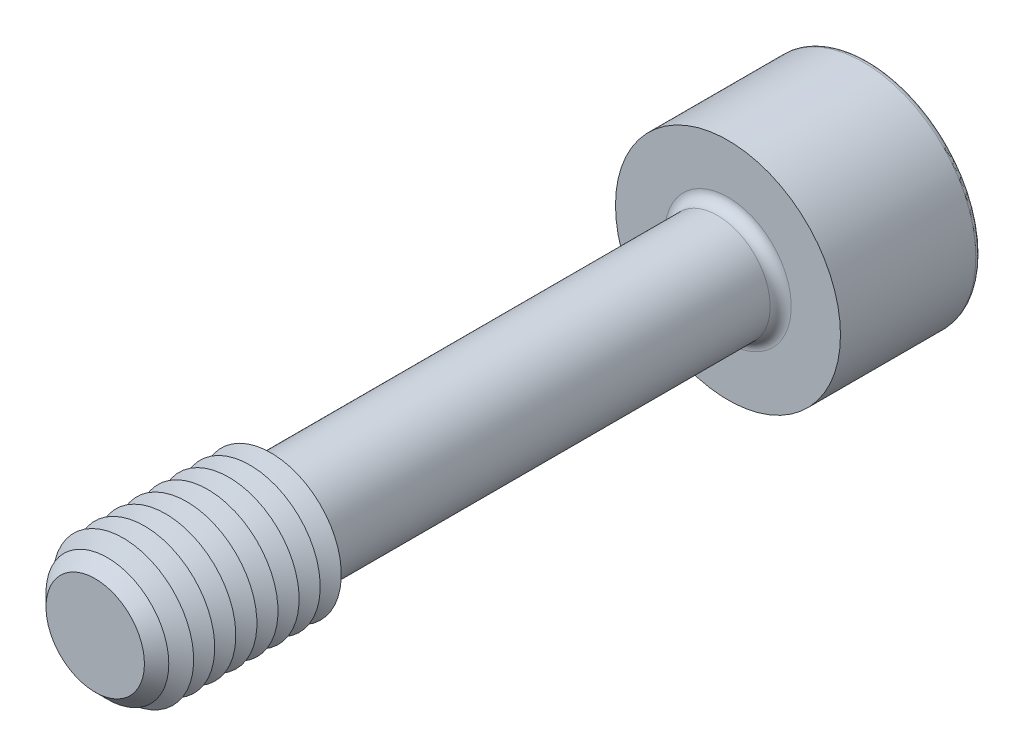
ISO-10303-21;
HEADER;
FILE_DESCRIPTION(('STEP AP214'),'2;1');
FILE_NAME('part.step','',(''),(''),'','','');
FILE_SCHEMA(('AUTOMOTIVE_DESIGN { 1 0 10303 214 1 1 1 1 }'));
ENDSEC;
DATA;
#1=APPLICATION_CONTEXT('core data for automotive mechanical design processes');
#2=APPLICATION_PROTOCOL_DEFINITION('international standard','automotive_design',2000,#1);
#3=PRODUCT_CONTEXT('',#1,'mechanical');
#4=PRODUCT('Part','Part','',(#3));
#5=PRODUCT_RELATED_PRODUCT_CATEGORY('part','',(#4));
#6=PRODUCT_DEFINITION_FORMATION('','',#4);
#7=PRODUCT_DEFINITION_CONTEXT('part definition',#1,'design');
#8=PRODUCT_DEFINITION('design','',#6,#7);
#9=PRODUCT_DEFINITION_SHAPE('','',#8);
#10=(LENGTH_UNIT() NAMED_UNIT(*) SI_UNIT(.MILLI.,.METRE.));
#11=(NAMED_UNIT(*) PLANE_ANGLE_UNIT() SI_UNIT($,.RADIAN.));
#12=(NAMED_UNIT(*) SI_UNIT($,.STERADIAN.) SOLID_ANGLE_UNIT());
#13=UNCERTAINTY_MEASURE_WITH_UNIT(LENGTH_MEASURE(1.E-05),#10,'distance_accuracy_value','');
#14=(GEOMETRIC_REPRESENTATION_CONTEXT(3) GLOBAL_UNCERTAINTY_ASSIGNED_CONTEXT((#13)) GLOBAL_UNIT_ASSIGNED_CONTEXT((#10,
#11,#12)) REPRESENTATION_CONTEXT('',''));
#15=CARTESIAN_POINT('',(0.,0.,0.));
#16=DIRECTION('',(0.,0.,1.));
#17=DIRECTION('',(1.,0.,0.));
#18=AXIS2_PLACEMENT_3D('',#15,#16,#17);
#19=CARTESIAN_POINT('',(-2.3094010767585,-4.,-24.5));
#20=DIRECTION('',(0.,0.,1.));
#21=DIRECTION('',(1.,0.,0.));
#22=AXIS2_PLACEMENT_3D('',#19,#20,#21);
#23=PLANE('',#22);
#24=DIRECTION('',(1.,0.,0.));
#25=VECTOR('',#24,1.);
#26=CARTESIAN_POINT('',(-2.3094010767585,-4.,-24.5));
#27=LINE('',#26,#25);
#28=CARTESIAN_POINT('',(0.,-4.,-24.5));
#29=VERTEX_POINT('',#28);
#30=CARTESIAN_POINT('',(2.3094010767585,-4.,-24.5));
#31=VERTEX_POINT('',#30);
#32=EDGE_CURVE('E763',#29,#31,#27,.T.);
#33=ORIENTED_EDGE('',*,*,#32,.F.);
#34=CARTESIAN_POINT('',(0.,0.,-24.5));
#35=DIRECTION('',(0.,0.,1.));
#36=DIRECTION('',(0.,-1.,0.));
#37=AXIS2_PLACEMENT_3D('',#34,#35,#36);
#38=CIRCLE('',#37,4.);
#39=CARTESIAN_POINT('',(3.46410161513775,-2.,-24.5));
#40=VERTEX_POINT('',#39);
#41=EDGE_CURVE('E53',#29,#40,#38,.T.);
#42=ORIENTED_EDGE('',*,*,#41,.T.);
#43=DIRECTION('',(0.5,0.866025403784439,0.));
#44=VECTOR('',#43,1.);
#45=CARTESIAN_POINT('',(2.3094010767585,-4.,-24.5));
#46=LINE('',#45,#44);
#47=EDGE_CURVE('E748',#31,#40,#46,.T.);
#48=ORIENTED_EDGE('',*,*,#47,.F.);
#49=EDGE_LOOP('',(#33,#42,#48));
#50=FACE_BOUND('',#49,.T.);
#51=ADVANCED_FACE('F41',(#50),#23,.F.);
#52=CARTESIAN_POINT('',(4.618802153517,0.,-24.5));
#53=VERTEX_POINT('',#52);
#54=EDGE_CURVE('E759',#40,#53,#46,.T.);
#55=ORIENTED_EDGE('',*,*,#54,.F.);
#56=CARTESIAN_POINT('',(3.46410161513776,2.,-24.5));
#57=VERTEX_POINT('',#56);
#58=EDGE_CURVE('E11',#40,#57,#38,.T.);
#59=ORIENTED_EDGE('',*,*,#58,.T.);
#60=DIRECTION('',(-0.5,0.866025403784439,0.));
#61=VECTOR('',#60,1.);
#62=CARTESIAN_POINT('',(4.618802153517,0.,-24.5));
#63=LINE('',#62,#61);
#64=EDGE_CURVE('E747',#53,#57,#63,.T.);
#65=ORIENTED_EDGE('',*,*,#64,.F.);
#66=EDGE_LOOP('',(#55,#59,#65));
#67=FACE_BOUND('',#66,.T.);
#68=ADVANCED_FACE('F133',(#67),#23,.F.);
#69=CARTESIAN_POINT('',(2.3094010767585,4.,-24.5));
#70=VERTEX_POINT('',#69);
#71=EDGE_CURVE('E743',#57,#70,#63,.T.);
#72=ORIENTED_EDGE('',*,*,#71,.F.);
#73=CARTESIAN_POINT('',(0.,4.,-24.5));
#74=VERTEX_POINT('',#73);
#75=EDGE_CURVE('E51',#57,#74,#38,.T.);
#76=ORIENTED_EDGE('',*,*,#75,.T.);
#77=DIRECTION('',(-1.,0.,0.));
#78=VECTOR('',#77,1.);
#79=CARTESIAN_POINT('',(2.3094010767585,4.,-24.5));
#80=LINE('',#79,#78);
#81=EDGE_CURVE('E177',#70,#74,#80,.T.);
#82=ORIENTED_EDGE('',*,*,#81,.F.);
#83=EDGE_LOOP('',(#72,#76,#82));
#84=FACE_BOUND('',#83,.T.);
#85=ADVANCED_FACE('F139',(#84),#23,.F.);
#86=CARTESIAN_POINT('',(-2.3094010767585,4.,-24.5));
#87=VERTEX_POINT('',#86);
#88=EDGE_CURVE('E753',#74,#87,#80,.T.);
#89=ORIENTED_EDGE('',*,*,#88,.F.);
#90=CARTESIAN_POINT('',(-3.46410161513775,2.,-24.5));
#91=VERTEX_POINT('',#90);
#92=EDGE_CURVE('E265',#74,#91,#38,.T.);
#93=ORIENTED_EDGE('',*,*,#92,.T.);
#94=DIRECTION('',(-0.500000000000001,-0.866025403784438,0.));
#95=VECTOR('',#94,1.);
#96=CARTESIAN_POINT('',(-2.3094010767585,4.,-24.5));
#97=LINE('',#96,#95);
#98=EDGE_CURVE('E176',#87,#91,#97,.T.);
#99=ORIENTED_EDGE('',*,*,#98,.F.);
#100=EDGE_LOOP('',(#89,#93,#99));
#101=FACE_BOUND('',#100,.T.);
#102=ADVANCED_FACE('F157',(#101),#23,.F.);
#103=CARTESIAN_POINT('',(-4.61880215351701,0.,-24.5));
#104=VERTEX_POINT('',#103);
#105=EDGE_CURVE('E170',#91,#104,#97,.T.);
#106=ORIENTED_EDGE('',*,*,#105,.F.);
#107=CARTESIAN_POINT('',(-3.46410161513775,-2.,-24.5));
#108=VERTEX_POINT('',#107);
#109=EDGE_CURVE('E172',#91,#108,#38,.T.);
#110=ORIENTED_EDGE('',*,*,#109,.T.);
#111=DIRECTION('',(0.5,-0.866025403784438,0.));
#112=VECTOR('',#111,1.);
#113=CARTESIAN_POINT('',(-4.61880215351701,0.,-24.5));
#114=LINE('',#113,#112);
#115=EDGE_CURVE('E174',#104,#108,#114,.T.);
#116=ORIENTED_EDGE('',*,*,#115,.F.);
#117=EDGE_LOOP('',(#106,#110,#116));
#118=FACE_BOUND('',#117,.T.);
#119=ADVANCED_FACE('F146',(#118),#23,.F.);
#120=CARTESIAN_POINT('',(0.,0.,-32.5));
#121=DIRECTION('',(0.,0.,-1.));
#122=DIRECTION('',(-1.,0.,0.));
#123=AXIS2_PLACEMENT_3D('',#120,#121,#122);
#124=PLANE('',#123);
#125=CARTESIAN_POINT('',(0.,0.,-32.5));
#126=DIRECTION('',(0.,0.,-1.));
#127=DIRECTION('',(-1.,0.,0.));
#128=AXIS2_PLACEMENT_3D('',#125,#126,#127);
#129=CIRCLE('',#128,7.625);
#130=CARTESIAN_POINT('',(-7.625,0.,-32.5));
#131=VERTEX_POINT('',#130);
#132=EDGE_CURVE('E250',#131,#131,#129,.T.);
#133=ORIENTED_EDGE('',*,*,#132,.T.);
#134=EDGE_LOOP('',(#133));
#135=FACE_BOUND('',#134,.T.);
#136=DIRECTION('',(-0.500000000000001,-0.866025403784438,0.));
#137=VECTOR('',#136,1.);
#138=CARTESIAN_POINT('',(-2.3094010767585,4.,-32.5));
#139=LINE('',#138,#137);
#140=CARTESIAN_POINT('',(-2.3094010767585,4.,-32.5));
#141=VERTEX_POINT('',#140);
#142=CARTESIAN_POINT('',(-4.61880215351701,0.,-32.5));
#143=VERTEX_POINT('',#142);
#144=EDGE_CURVE('E212',#141,#143,#139,.T.);
#145=ORIENTED_EDGE('',*,*,#144,.T.);
#146=DIRECTION('',(0.5,-0.866025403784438,0.));
#147=VECTOR('',#146,1.);
#148=CARTESIAN_POINT('',(-4.61880215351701,0.,-32.5));
#149=LINE('',#148,#147);
#150=CARTESIAN_POINT('',(-2.3094010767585,-4.,-32.5));
#151=VERTEX_POINT('',#150);
#152=EDGE_CURVE('E67',#143,#151,#149,.T.);
#153=ORIENTED_EDGE('',*,*,#152,.T.);
#154=DIRECTION('',(1.,0.,0.));
#155=VECTOR('',#154,1.);
#156=CARTESIAN_POINT('',(-2.3094010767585,-4.,-32.5));
#157=LINE('',#156,#155);
#158=CARTESIAN_POINT('',(2.3094010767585,-4.,-32.5));
#159=VERTEX_POINT('',#158);
#160=EDGE_CURVE('E196',#151,#159,#157,.T.);
#161=ORIENTED_EDGE('',*,*,#160,.T.);
#162=DIRECTION('',(0.5,0.866025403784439,0.));
#163=VECTOR('',#162,1.);
#164=CARTESIAN_POINT('',(2.3094010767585,-4.,-32.5));
#165=LINE('',#164,#163);
#166=CARTESIAN_POINT('',(4.618802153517,0.,-32.5));
#167=VERTEX_POINT('',#166);
#168=EDGE_CURVE('E200',#159,#167,#165,.T.);
#169=ORIENTED_EDGE('',*,*,#168,.T.);
#170=DIRECTION('',(-0.5,0.866025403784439,0.));
#171=VECTOR('',#170,1.);
#172=CARTESIAN_POINT('',(4.618802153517,0.,-32.5));
#173=LINE('',#172,#171);
#174=CARTESIAN_POINT('',(2.3094010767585,4.,-32.5));
#175=VERTEX_POINT('',#174);
#176=EDGE_CURVE('E204',#167,#175,#173,.T.);
#177=ORIENTED_EDGE('',*,*,#176,.T.);
#178=DIRECTION('',(-1.,0.,0.));
#179=VECTOR('',#178,1.);
#180=CARTESIAN_POINT('',(2.3094010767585,4.,-32.5));
#181=LINE('',#180,#179);
#182=EDGE_CURVE('E208',#175,#141,#181,.T.);
#183=ORIENTED_EDGE('',*,*,#182,.T.);
#184=EDGE_LOOP('',(#145,#153,#161,#169,#177,#183));
#185=FACE_BOUND('',#184,.T.);
#186=ADVANCED_FACE('F156',(#135,#185),#124,.T.);
#187=CARTESIAN_POINT('',(0.,0.,22.5));
#188=DIRECTION('',(0.,0.,-1.));
#189=DIRECTION('',(-1.,0.,0.));
#190=AXIS2_PLACEMENT_3D('',#187,#188,#189);
#191=CYLINDRICAL_SURFACE('',#190,3.75);
#192=CARTESIAN_POINT('',(0.,0.,-21.75));
#193=DIRECTION('',(0.,0.,-1.));
#194=DIRECTION('',(-1.,0.,0.));
#195=AXIS2_PLACEMENT_3D('',#192,#193,#194);
#196=CIRCLE('',#195,3.75);
#197=CARTESIAN_POINT('',(-3.75,0.,-21.75));
#198=VERTEX_POINT('',#197);
#199=EDGE_CURVE('E246',#198,#198,#196,.F.);
#200=CARTESIAN_POINT('',(0.,0.,9.27831216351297));
#201=DIRECTION('',(0.,0.,-1.));
#202=DIRECTION('',(0.,1.,0.));
#203=AXIS2_PLACEMENT_3D('',#200,#201,#202);
#204=CIRCLE('',#203,3.75);
#205=CARTESIAN_POINT('',(-3.75,0.,9.27831216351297));
#206=VERTEX_POINT('',#205);
#207=EDGE_CURVE('E234',#206,#206,#204,.T.);
#208=CARTESIAN_POINT('',(-3.75,0.,-21.75));
#209=CARTESIAN_POINT('',(-3.75,0.,-21.4267884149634));
#210=CARTESIAN_POINT('',(-3.75,0.,-21.1035768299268));
#211=CARTESIAN_POINT('',(-3.75,0.,-20.4571536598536));
#212=CARTESIAN_POINT('',(-3.75,0.,-20.133942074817));
#213=CARTESIAN_POINT('',(-3.75,0.,-19.4875189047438));
#214=CARTESIAN_POINT('',(-3.75,0.,-19.1643073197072));
#215=CARTESIAN_POINT('',(-3.75,0.,-18.5178841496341));
#216=CARTESIAN_POINT('',(-3.75,0.,-18.1946725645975));
#217=CARTESIAN_POINT('',(-3.75,0.,-17.5482493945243));
#218=CARTESIAN_POINT('',(-3.75,0.,-17.2250378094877));
#219=CARTESIAN_POINT('',(-3.75,0.,-16.5786146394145));
#220=CARTESIAN_POINT('',(-3.75,0.,-16.2554030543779));
#221=CARTESIAN_POINT('',(-3.75,0.,-15.6089798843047));
#222=CARTESIAN_POINT('',(-3.75,0.,-15.2857682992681));
#223=CARTESIAN_POINT('',(-3.75,0.,-14.6393451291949));
#224=CARTESIAN_POINT('',(-3.75,0.,-14.3161335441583));
#225=CARTESIAN_POINT('',(-3.75,0.,-13.6697103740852));
#226=CARTESIAN_POINT('',(-3.75,0.,-13.3464987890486));
#227=CARTESIAN_POINT('',(-3.75,0.,-12.7000756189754));
#228=CARTESIAN_POINT('',(-3.75,0.,-12.3768640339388));
#229=CARTESIAN_POINT('',(-3.75,0.,-11.7304408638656));
#230=CARTESIAN_POINT('',(-3.75,0.,-11.407229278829));
#231=CARTESIAN_POINT('',(-3.75,0.,-10.7608061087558));
#232=CARTESIAN_POINT('',(-3.75,0.,-10.4375945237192));
#233=CARTESIAN_POINT('',(-3.75,0.,-9.79117135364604));
#234=CARTESIAN_POINT('',(-3.75,0.,-9.46795976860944));
#235=CARTESIAN_POINT('',(-3.75,0.,-8.82153659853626));
#236=CARTESIAN_POINT('',(-3.75,0.,-8.49832501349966));
#237=CARTESIAN_POINT('',(-3.75,0.,-7.85190184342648));
#238=CARTESIAN_POINT('',(-3.75,0.,-7.52869025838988));
#239=CARTESIAN_POINT('',(-3.75,0.,-6.8822670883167));
#240=CARTESIAN_POINT('',(-3.75,0.,-6.5590555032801));
#241=CARTESIAN_POINT('',(-3.75,0.,-5.91263233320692));
#242=CARTESIAN_POINT('',(-3.75,0.,-5.58942074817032));
#243=CARTESIAN_POINT('',(-3.75,0.,-4.94299757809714));
#244=CARTESIAN_POINT('',(-3.75,0.,-4.61978599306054));
#245=CARTESIAN_POINT('',(-3.75,0.,-3.97336282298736));
#246=CARTESIAN_POINT('',(-3.75,0.,-3.65015123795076));
#247=CARTESIAN_POINT('',(-3.75,0.,-3.00372806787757));
#248=CARTESIAN_POINT('',(-3.75,0.,-2.68051648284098));
#249=CARTESIAN_POINT('',(-3.75,0.,-2.0340933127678));
#250=CARTESIAN_POINT('',(-3.75,0.,-1.7108817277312));
#251=CARTESIAN_POINT('',(-3.75,0.,-1.06445855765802));
#252=CARTESIAN_POINT('',(-3.75,0.,-0.741246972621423));
#253=CARTESIAN_POINT('',(-3.75,0.,-0.0948238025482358));
#254=CARTESIAN_POINT('',(-3.75,0.,0.228387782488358));
#255=CARTESIAN_POINT('',(-3.75,0.,0.874810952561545));
#256=CARTESIAN_POINT('',(-3.75,0.,1.19802253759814));
#257=CARTESIAN_POINT('',(-3.75,0.,1.84444570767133));
#258=CARTESIAN_POINT('',(-3.75,0.,2.16765729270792));
#259=CARTESIAN_POINT('',(-3.75,0.,2.81408046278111));
#260=CARTESIAN_POINT('',(-3.75,0.,3.1372920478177));
#261=CARTESIAN_POINT('',(-3.75,0.,3.78371521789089));
#262=CARTESIAN_POINT('',(-3.75,0.,4.10692680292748));
#263=CARTESIAN_POINT('',(-3.75,0.,4.75334997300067));
#264=CARTESIAN_POINT('',(-3.75,0.,5.07656155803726));
#265=CARTESIAN_POINT('',(-3.75,0.,5.72298472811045));
#266=CARTESIAN_POINT('',(-3.75,0.,6.04619631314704));
#267=CARTESIAN_POINT('',(-3.75,0.,6.69261948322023));
#268=CARTESIAN_POINT('',(-3.75,0.,7.01583106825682));
#269=CARTESIAN_POINT('',(-3.75,0.,7.66225423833));
#270=CARTESIAN_POINT('',(-3.75,0.,7.9854658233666));
#271=CARTESIAN_POINT('',(-3.75,0.,8.63188899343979));
#272=CARTESIAN_POINT('',(-3.75,0.,8.95510057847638));
#273=CARTESIAN_POINT('',(-3.75,0.,9.27831216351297));
#274=B_SPLINE_CURVE_WITH_KNOTS('',3,(#208,#209,#210,#211,#212,#213,#214,#215,#216,#217,#218,
#219,#220,#221,#222,#223,#224,#225,#226,#227,#228,#229,#230,#231,#232,#233,#234,#235,#236,#237,
#238,#239,#240,#241,#242,#243,#244,#245,#246,#247,#248,#249,#250,#251,#252,#253,#254,#255,#256,
#257,#258,#259,#260,#261,#262,#263,#264,#265,#266,#267,#268,#269,#270,#271,#272,#273),
.UNSPECIFIED.,.F.,.F.,(4,2,2,2,2,2,2,2,2,2,2,2,2,2,2,2,2,2,2,2,2,2,2,2,2,2,2,2,2,2,2,2,4),(0.,
0.969634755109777,1.93926951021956,2.90890426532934,3.87853902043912,4.8481737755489,
5.81780853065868,6.78744328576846,7.75707804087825,8.72671279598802,9.6963475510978,
10.6659823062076,11.6356170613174,12.6052518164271,13.5748865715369,14.5445213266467,
15.5141560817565,16.4837908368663,17.453425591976,18.4230603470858,19.3926951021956,
20.3623298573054,21.3319646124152,22.3015993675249,23.2712341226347,24.2408688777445,
25.2105036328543,26.1801383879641,27.1497731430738,28.1194078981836,29.0890426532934,
30.0586774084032,31.028312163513),.UNSPECIFIED.);
#275=EDGE_CURVE('BSEAM163',#198,#206,#274,.T.);
#276=ORIENTED_EDGE('',*,*,#199,.T.);
#277=ORIENTED_EDGE('',*,*,#207,.T.);
#278=ORIENTED_EDGE('',*,*,#275,.T.);
#279=ORIENTED_EDGE('',*,*,#275,.F.);
#280=EDGE_LOOP('',(#276,#278,#277,#279));
#281=FACE_BOUND('',#280,.T.);
#282=ADVANCED_FACE('F163',(#281),#191,.T.);
#283=CARTESIAN_POINT('',(0.,0.,9.27831216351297));
#284=DIRECTION('',(0.,0.,1.));
#285=DIRECTION('',(0.,-1.,0.));
#286=AXIS2_PLACEMENT_3D('',#283,#284,#285);
#287=CONICAL_SURFACE('',#286,3.75,1.0471975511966);
#288=CARTESIAN_POINT('',(0.,0.,10.));
#289=DIRECTION('',(0.,0.,-1.));
#290=DIRECTION('',(-1.,0.,0.));
#291=AXIS2_PLACEMENT_3D('',#288,#289,#290);
#292=CIRCLE('',#291,5.);
#293=CARTESIAN_POINT('',(-5.,0.,10.));
#294=VERTEX_POINT('',#293);
#295=EDGE_CURVE('E269',#294,#294,#292,.T.);
#296=ORIENTED_EDGE('',*,*,#295,.T.);
#297=EDGE_LOOP('',(#296));
#298=FACE_BOUND('',#297,.T.);
#299=ORIENTED_EDGE('',*,*,#207,.F.);
#300=EDGE_LOOP('',(#299));
#301=FACE_BOUND('',#300,.T.);
#302=ADVANCED_FACE('F512',(#298,#301),#287,.T.);
#303=CARTESIAN_POINT('',(0.,0.,-22.5));
#304=DIRECTION('',(0.,0.,-1.));
#305=DIRECTION('',(-1.,0.,0.));
#306=AXIS2_PLACEMENT_3D('',#303,#304,#305);
#307=PLANE('',#306);
#308=CARTESIAN_POINT('',(0.,0.,-22.5));
#309=DIRECTION('',(0.,0.,-1.));
#310=DIRECTION('',(-1.,0.,0.));
#311=AXIS2_PLACEMENT_3D('',#308,#309,#310);
#312=CIRCLE('',#311,4.5);
#313=CARTESIAN_POINT('',(-4.5,0.,-22.5));
#314=VERTEX_POINT('',#313);
#315=EDGE_CURVE('E242',#314,#314,#312,.T.);
#316=ORIENTED_EDGE('',*,*,#315,.T.);
#317=EDGE_LOOP('',(#316));
#318=FACE_BOUND('',#317,.T.);
#319=CARTESIAN_POINT('',(0.,0.,-22.5));
#320=DIRECTION('',(0.,0.,-1.));
#321=DIRECTION('',(-1.,0.,0.));
#322=AXIS2_PLACEMENT_3D('',#319,#320,#321);
#323=CIRCLE('',#322,8.);
#324=CARTESIAN_POINT('',(-8.,0.,-22.5));
#325=VERTEX_POINT('',#324);
#326=EDGE_CURVE('E230',#325,#325,#323,.T.);
#327=ORIENTED_EDGE('',*,*,#326,.F.);
#328=EDGE_LOOP('',(#327));
#329=FACE_BOUND('',#328,.T.);
#330=ADVANCED_FACE('F505',(#318,#329),#307,.F.);
#331=CARTESIAN_POINT('',(0.,0.,-32.5));
#332=DIRECTION('',(0.,0.,1.));
#333=DIRECTION('',(1.,0.,0.));
#334=AXIS2_PLACEMENT_3D('',#331,#332,#333);
#335=CYLINDRICAL_SURFACE('',#334,8.);
#336=CARTESIAN_POINT('',(0.,0.,-32.125));
#337=DIRECTION('',(0.,0.,-1.));
#338=DIRECTION('',(-1.,0.,0.));
#339=AXIS2_PLACEMENT_3D('',#336,#337,#338);
#340=CIRCLE('',#339,8.);
#341=CARTESIAN_POINT('',(-8.,0.,-32.125));
#342=VERTEX_POINT('',#341);
#343=EDGE_CURVE('E253',#342,#342,#340,.F.);
#344=ORIENTED_EDGE('',*,*,#343,.T.);
#345=EDGE_LOOP('',(#344));
#346=FACE_BOUND('',#345,.T.);
#347=ORIENTED_EDGE('',*,*,#326,.T.);
#348=EDGE_LOOP('',(#347));
#349=FACE_BOUND('',#348,.T.);
#350=ADVANCED_FACE('F511',(#346,#349),#335,.T.);
#351=CARTESIAN_POINT('',(-4.61880215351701,0.,-24.5));
#352=DIRECTION('',(0.866025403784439,0.5,0.));
#353=DIRECTION('',(-0.5,0.866025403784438,0.));
#354=AXIS2_PLACEMENT_3D('',#351,#352,#353);
#355=PLANE('',#354);
#356=ORIENTED_EDGE('',*,*,#152,.F.);
#357=DIRECTION('',(0.,0.,-1.));
#358=VECTOR('',#357,1.);
#359=CARTESIAN_POINT('',(-4.61880215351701,0.,-24.5));
#360=LINE('',#359,#358);
#361=EDGE_CURVE('E186',#104,#143,#360,.T.);
#362=ORIENTED_EDGE('',*,*,#361,.F.);
#363=ORIENTED_EDGE('',*,*,#115,.T.);
#364=CARTESIAN_POINT('',(-2.3094010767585,-4.,-24.5));
#365=VERTEX_POINT('',#364);
#366=EDGE_CURVE('E215',#108,#365,#114,.T.);
#367=ORIENTED_EDGE('',*,*,#366,.T.);
#368=DIRECTION('',(0.,0.,-1.));
#369=VECTOR('',#368,1.);
#370=CARTESIAN_POINT('',(-2.3094010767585,-4.,-24.5));
#371=LINE('',#370,#369);
#372=EDGE_CURVE('E228',#365,#151,#371,.T.);
#373=ORIENTED_EDGE('',*,*,#372,.T.);
#374=EDGE_LOOP('',(#356,#362,#363,#367,#373));
#375=FACE_BOUND('',#374,.T.);
#376=ADVANCED_FACE('F523',(#375),#355,.T.);
#377=CARTESIAN_POINT('',(-2.3094010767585,-4.,-24.5));
#378=DIRECTION('',(0.,1.,0.));
#379=DIRECTION('',(-1.,0.,0.));
#380=AXIS2_PLACEMENT_3D('',#377,#378,#379);
#381=PLANE('',#380);
#382=ORIENTED_EDGE('',*,*,#160,.F.);
#383=ORIENTED_EDGE('',*,*,#372,.F.);
#384=EDGE_CURVE('E760',#365,#29,#27,.T.);
#385=ORIENTED_EDGE('',*,*,#384,.T.);
#386=ORIENTED_EDGE('',*,*,#32,.T.);
#387=DIRECTION('',(0.,0.,-1.));
#388=VECTOR('',#387,1.);
#389=CARTESIAN_POINT('',(2.3094010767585,-4.,-24.5));
#390=LINE('',#389,#388);
#391=EDGE_CURVE('E225',#31,#159,#390,.T.);
#392=ORIENTED_EDGE('',*,*,#391,.T.);
#393=EDGE_LOOP('',(#382,#383,#385,#386,#392));
#394=FACE_BOUND('',#393,.T.);
#395=ADVANCED_FACE('F539',(#394),#381,.T.);
#396=CARTESIAN_POINT('',(2.3094010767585,-4.,-24.5));
#397=DIRECTION('',(-0.866025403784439,0.5,0.));
#398=DIRECTION('',(-0.5,-0.866025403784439,0.));
#399=AXIS2_PLACEMENT_3D('',#396,#397,#398);
#400=PLANE('',#399);
#401=ORIENTED_EDGE('',*,*,#168,.F.);
#402=ORIENTED_EDGE('',*,*,#391,.F.);
#403=ORIENTED_EDGE('',*,*,#47,.T.);
#404=ORIENTED_EDGE('',*,*,#54,.T.);
#405=DIRECTION('',(0.,0.,-1.));
#406=VECTOR('',#405,1.);
#407=CARTESIAN_POINT('',(4.618802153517,0.,-24.5));
#408=LINE('',#407,#406);
#409=EDGE_CURVE('E222',#53,#167,#408,.T.);
#410=ORIENTED_EDGE('',*,*,#409,.T.);
#411=EDGE_LOOP('',(#401,#402,#403,#404,#410));
#412=FACE_BOUND('',#411,.T.);
#413=ADVANCED_FACE('F549',(#412),#400,.T.);
#414=CARTESIAN_POINT('',(4.618802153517,0.,-24.5));
#415=DIRECTION('',(-0.866025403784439,-0.5,0.));
#416=DIRECTION('',(0.5,-0.866025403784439,0.));
#417=AXIS2_PLACEMENT_3D('',#414,#415,#416);
#418=PLANE('',#417);
#419=ORIENTED_EDGE('',*,*,#176,.F.);
#420=ORIENTED_EDGE('',*,*,#409,.F.);
#421=ORIENTED_EDGE('',*,*,#64,.T.);
#422=ORIENTED_EDGE('',*,*,#71,.T.);
#423=DIRECTION('',(0.,0.,-1.));
#424=VECTOR('',#423,1.);
#425=CARTESIAN_POINT('',(2.3094010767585,4.,-24.5));
#426=LINE('',#425,#424);
#427=EDGE_CURVE('E219',#70,#175,#426,.T.);
#428=ORIENTED_EDGE('',*,*,#427,.T.);
#429=EDGE_LOOP('',(#419,#420,#421,#422,#428));
#430=FACE_BOUND('',#429,.T.);
#431=ADVANCED_FACE('F559',(#430),#418,.T.);
#432=CARTESIAN_POINT('',(2.3094010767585,4.,-24.5));
#433=DIRECTION('',(0.,-1.,0.));
#434=DIRECTION('',(0.,0.,-1.));
#435=AXIS2_PLACEMENT_3D('',#432,#433,#434);
#436=PLANE('',#435);
#437=ORIENTED_EDGE('',*,*,#182,.F.);
#438=ORIENTED_EDGE('',*,*,#427,.F.);
#439=ORIENTED_EDGE('',*,*,#81,.T.);
#440=ORIENTED_EDGE('',*,*,#88,.T.);
#441=DIRECTION('',(0.,0.,-1.));
#442=VECTOR('',#441,1.);
#443=CARTESIAN_POINT('',(-2.3094010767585,4.,-24.5));
#444=LINE('',#443,#442);
#445=EDGE_CURVE('E182',#87,#141,#444,.T.);
#446=ORIENTED_EDGE('',*,*,#445,.T.);
#447=EDGE_LOOP('',(#437,#438,#439,#440,#446));
#448=FACE_BOUND('',#447,.T.);
#449=ADVANCED_FACE('F152',(#448),#436,.T.);
#450=CARTESIAN_POINT('',(-2.3094010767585,4.,-24.5));
#451=DIRECTION('',(0.866025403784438,-0.500000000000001,0.));
#452=DIRECTION('',(0.500000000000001,0.866025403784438,0.));
#453=AXIS2_PLACEMENT_3D('',#450,#451,#452);
#454=PLANE('',#453);
#455=ORIENTED_EDGE('',*,*,#144,.F.);
#456=ORIENTED_EDGE('',*,*,#445,.F.);
#457=ORIENTED_EDGE('',*,*,#98,.T.);
#458=ORIENTED_EDGE('',*,*,#105,.T.);
#459=ORIENTED_EDGE('',*,*,#361,.T.);
#460=EDGE_LOOP('',(#455,#456,#457,#458,#459));
#461=FACE_BOUND('',#460,.T.);
#462=ADVANCED_FACE('F144',(#461),#454,.T.);
#463=ORIENTED_EDGE('',*,*,#366,.F.);
#464=EDGE_CURVE('E256',#108,#29,#38,.T.);
#465=ORIENTED_EDGE('',*,*,#464,.T.);
#466=ORIENTED_EDGE('',*,*,#384,.F.);
#467=EDGE_LOOP('',(#463,#465,#466));
#468=FACE_BOUND('',#467,.T.);
#469=ADVANCED_FACE('F135',(#468),#23,.F.);
#470=CARTESIAN_POINT('',(0.,0.,-21.75));
#471=DIRECTION('',(0.,0.,-1.));
#472=DIRECTION('',(-1.,0.,0.));
#473=AXIS2_PLACEMENT_3D('',#470,#471,#472);
#474=TOROIDAL_SURFACE('',#473,4.5,0.75);
#475=ORIENTED_EDGE('',*,*,#199,.F.);
#476=EDGE_LOOP('',(#475));
#477=FACE_BOUND('',#476,.T.);
#478=ORIENTED_EDGE('',*,*,#315,.F.);
#479=EDGE_LOOP('',(#478));
#480=FACE_BOUND('',#479,.T.);
#481=ADVANCED_FACE('F129',(#477,#480),#474,.F.);
#482=CARTESIAN_POINT('',(0.,0.,-32.125));
#483=DIRECTION('',(0.,0.,-1.));
#484=DIRECTION('',(-1.,0.,0.));
#485=AXIS2_PLACEMENT_3D('',#482,#483,#484);
#486=TOROIDAL_SURFACE('',#485,7.625,0.375);
#487=ORIENTED_EDGE('',*,*,#343,.F.);
#488=EDGE_LOOP('',(#487));
#489=FACE_BOUND('',#488,.T.);
#490=ORIENTED_EDGE('',*,*,#132,.F.);
#491=EDGE_LOOP('',(#490));
#492=FACE_BOUND('',#491,.T.);
#493=ADVANCED_FACE('F43',(#489,#492),#486,.T.);
#494=CARTESIAN_POINT('',(0.,0.,-22.1905989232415));
#495=DIRECTION('',(0.,0.,-1.));
#496=DIRECTION('',(0.,1.,0.));
#497=AXIS2_PLACEMENT_3D('',#494,#495,#496);
#498=CONICAL_SURFACE('',#497,0.,1.0471975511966);
#499=ORIENTED_EDGE('',*,*,#41,.F.);
#500=ORIENTED_EDGE('',*,*,#464,.F.);
#501=ORIENTED_EDGE('',*,*,#109,.F.);
#502=ORIENTED_EDGE('',*,*,#92,.F.);
#503=ORIENTED_EDGE('',*,*,#75,.F.);
#504=ORIENTED_EDGE('',*,*,#58,.F.);
#505=EDGE_LOOP('',(#499,#500,#501,#502,#503,#504));
#506=FACE_BOUND('',#505,.T.);
#507=CARTESIAN_POINT('',(0.,0.,-22.1905989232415));
#508=VERTEX_POINT('',#507);
#509=VERTEX_LOOP('',#508);
#510=FACE_BOUND('',#509,.T.);
#511=ADVANCED_FACE('F118',(#506,#510),#498,.F.);
#512=CARTESIAN_POINT('',(0.,0.,10.75));
#513=DIRECTION('',(0.,0.,-1.));
#514=DIRECTION('',(-1.,0.,0.));
#515=AXIS2_PLACEMENT_3D('',#512,#513,#514);
#516=CONICAL_SURFACE('',#515,3.70096189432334,1.0471975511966);
#517=ORIENTED_EDGE('',*,*,#295,.F.);
#518=EDGE_LOOP('',(#517));
#519=FACE_BOUND('',#518,.T.);
#520=CARTESIAN_POINT('',(0.,0.,10.75));
#521=DIRECTION('',(0.,0.,-1.));
#522=DIRECTION('',(-1.,0.,0.));
#523=AXIS2_PLACEMENT_3D('',#520,#521,#522);
#524=CIRCLE('',#523,3.70096189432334);
#525=CARTESIAN_POINT('',(-3.70096189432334,0.,10.75));
#526=VERTEX_POINT('',#525);
#527=EDGE_CURVE('E275',#526,#526,#524,.T.);
#528=ORIENTED_EDGE('',*,*,#527,.T.);
#529=EDGE_LOOP('',(#528));
#530=FACE_BOUND('',#529,.T.);
#531=ADVANCED_FACE('F120',(#519,#530),#516,.T.);
#532=CARTESIAN_POINT('',(0.,0.,11.5));
#533=DIRECTION('',(0.,0.,1.));
#534=DIRECTION('',(1.,0.,0.));
#535=AXIS2_PLACEMENT_3D('',#532,#533,#534);
#536=CONICAL_SURFACE('',#535,5.,1.0471975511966);
#537=ORIENTED_EDGE('',*,*,#527,.F.);
#538=EDGE_LOOP('',(#537));
#539=FACE_BOUND('',#538,.T.);
#540=CARTESIAN_POINT('',(0.,0.,11.5));
#541=DIRECTION('',(0.,0.,-1.));
#542=DIRECTION('',(-1.,0.,0.));
#543=AXIS2_PLACEMENT_3D('',#540,#541,#542);
#544=CIRCLE('',#543,5.);
#545=CARTESIAN_POINT('',(-5.,0.,11.5));
#546=VERTEX_POINT('',#545);
#547=EDGE_CURVE('E280',#546,#546,#544,.T.);
#548=ORIENTED_EDGE('',*,*,#547,.T.);
#549=EDGE_LOOP('',(#548));
#550=FACE_BOUND('',#549,.T.);
#551=ADVANCED_FACE('F126',(#539,#550),#536,.T.);
#552=CARTESIAN_POINT('',(0.,0.,12.25));
#553=DIRECTION('',(0.,0.,-1.));
#554=DIRECTION('',(-1.,0.,0.));
#555=AXIS2_PLACEMENT_3D('',#552,#553,#554);
#556=CONICAL_SURFACE('',#555,3.70096189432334,1.0471975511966);
#557=ORIENTED_EDGE('',*,*,#547,.F.);
#558=EDGE_LOOP('',(#557));
#559=FACE_BOUND('',#558,.T.);
#560=CARTESIAN_POINT('',(0.,0.,12.25));
#561=DIRECTION('',(0.,0.,-1.));
#562=DIRECTION('',(-1.,0.,0.));
#563=AXIS2_PLACEMENT_3D('',#560,#561,#562);
#564=CIRCLE('',#563,3.70096189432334);
#565=CARTESIAN_POINT('',(-3.70096189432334,0.,12.25));
#566=VERTEX_POINT('',#565);
#567=EDGE_CURVE('E285',#566,#566,#564,.T.);
#568=ORIENTED_EDGE('',*,*,#567,.T.);
#569=EDGE_LOOP('',(#568));
#570=FACE_BOUND('',#569,.T.);
#571=ADVANCED_FACE('F399',(#559,#570),#556,.T.);
#572=CARTESIAN_POINT('',(0.,0.,13.));
#573=DIRECTION('',(0.,0.,1.));
#574=DIRECTION('',(1.,0.,0.));
#575=AXIS2_PLACEMENT_3D('',#572,#573,#574);
#576=CONICAL_SURFACE('',#575,5.,1.0471975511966);
#577=ORIENTED_EDGE('',*,*,#567,.F.);
#578=EDGE_LOOP('',(#577));
#579=FACE_BOUND('',#578,.T.);
#580=CARTESIAN_POINT('',(0.,0.,13.));
#581=DIRECTION('',(0.,0.,-1.));
#582=DIRECTION('',(-1.,0.,0.));
#583=AXIS2_PLACEMENT_3D('',#580,#581,#582);
#584=CIRCLE('',#583,5.);
#585=CARTESIAN_POINT('',(-5.,0.,13.));
#586=VERTEX_POINT('',#585);
#587=EDGE_CURVE('E289',#586,#586,#584,.T.);
#588=ORIENTED_EDGE('',*,*,#587,.T.);
#589=EDGE_LOOP('',(#588));
#590=FACE_BOUND('',#589,.T.);
#591=ADVANCED_FACE('F395',(#579,#590),#576,.T.);
#592=CARTESIAN_POINT('',(0.,0.,13.75));
#593=DIRECTION('',(0.,0.,-1.));
#594=DIRECTION('',(-1.,0.,0.));
#595=AXIS2_PLACEMENT_3D('',#592,#593,#594);
#596=CONICAL_SURFACE('',#595,3.70096189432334,1.0471975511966);
#597=ORIENTED_EDGE('',*,*,#587,.F.);
#598=EDGE_LOOP('',(#597));
#599=FACE_BOUND('',#598,.T.);
#600=CARTESIAN_POINT('',(0.,0.,13.75));
#601=DIRECTION('',(0.,0.,-1.));
#602=DIRECTION('',(-1.,0.,0.));
#603=AXIS2_PLACEMENT_3D('',#600,#601,#602);
#604=CIRCLE('',#603,3.70096189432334);
#605=CARTESIAN_POINT('',(-3.70096189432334,0.,13.75));
#606=VERTEX_POINT('',#605);
#607=EDGE_CURVE('E293',#606,#606,#604,.T.);
#608=ORIENTED_EDGE('',*,*,#607,.T.);
#609=EDGE_LOOP('',(#608));
#610=FACE_BOUND('',#609,.T.);
#611=ADVANCED_FACE('F391',(#599,#610),#596,.T.);
#612=CARTESIAN_POINT('',(0.,0.,14.5));
#613=DIRECTION('',(0.,0.,1.));
#614=DIRECTION('',(1.,0.,0.));
#615=AXIS2_PLACEMENT_3D('',#612,#613,#614);
#616=CONICAL_SURFACE('',#615,5.,1.0471975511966);
#617=ORIENTED_EDGE('',*,*,#607,.F.);
#618=EDGE_LOOP('',(#617));
#619=FACE_BOUND('',#618,.T.);
#620=CARTESIAN_POINT('',(0.,0.,14.5));
#621=DIRECTION('',(0.,0.,-1.));
#622=DIRECTION('',(-1.,0.,0.));
#623=AXIS2_PLACEMENT_3D('',#620,#621,#622);
#624=CIRCLE('',#623,5.);
#625=CARTESIAN_POINT('',(-5.,0.,14.5));
#626=VERTEX_POINT('',#625);
#627=EDGE_CURVE('E297',#626,#626,#624,.T.);
#628=ORIENTED_EDGE('',*,*,#627,.T.);
#629=EDGE_LOOP('',(#628));
#630=FACE_BOUND('',#629,.T.);
#631=ADVANCED_FACE('F387',(#619,#630),#616,.T.);
#632=CARTESIAN_POINT('',(0.,0.,15.25));
#633=DIRECTION('',(0.,0.,-1.));
#634=DIRECTION('',(-1.,0.,0.));
#635=AXIS2_PLACEMENT_3D('',#632,#633,#634);
#636=CONICAL_SURFACE('',#635,3.70096189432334,1.0471975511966);
#637=ORIENTED_EDGE('',*,*,#627,.F.);
#638=EDGE_LOOP('',(#637));
#639=FACE_BOUND('',#638,.T.);
#640=CARTESIAN_POINT('',(0.,0.,15.25));
#641=DIRECTION('',(0.,0.,-1.));
#642=DIRECTION('',(-1.,0.,0.));
#643=AXIS2_PLACEMENT_3D('',#640,#641,#642);
#644=CIRCLE('',#643,3.70096189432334);
#645=CARTESIAN_POINT('',(-3.70096189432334,0.,15.25));
#646=VERTEX_POINT('',#645);
#647=EDGE_CURVE('E301',#646,#646,#644,.T.);
#648=ORIENTED_EDGE('',*,*,#647,.T.);
#649=EDGE_LOOP('',(#648));
#650=FACE_BOUND('',#649,.T.);
#651=ADVANCED_FACE('F383',(#639,#650),#636,.T.);
#652=CARTESIAN_POINT('',(0.,0.,16.));
#653=DIRECTION('',(0.,0.,1.));
#654=DIRECTION('',(1.,0.,0.));
#655=AXIS2_PLACEMENT_3D('',#652,#653,#654);
#656=CONICAL_SURFACE('',#655,5.,1.0471975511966);
#657=ORIENTED_EDGE('',*,*,#647,.F.);
#658=EDGE_LOOP('',(#657));
#659=FACE_BOUND('',#658,.T.);
#660=CARTESIAN_POINT('',(0.,0.,16.));
#661=DIRECTION('',(0.,0.,-1.));
#662=DIRECTION('',(-1.,0.,0.));
#663=AXIS2_PLACEMENT_3D('',#660,#661,#662);
#664=CIRCLE('',#663,5.);
#665=CARTESIAN_POINT('',(-5.,0.,16.));
#666=VERTEX_POINT('',#665);
#667=EDGE_CURVE('E305',#666,#666,#664,.T.);
#668=ORIENTED_EDGE('',*,*,#667,.T.);
#669=EDGE_LOOP('',(#668));
#670=FACE_BOUND('',#669,.T.);
#671=ADVANCED_FACE('F379',(#659,#670),#656,.T.);
#672=CARTESIAN_POINT('',(0.,0.,16.75));
#673=DIRECTION('',(0.,0.,-1.));
#674=DIRECTION('',(-1.,0.,0.));
#675=AXIS2_PLACEMENT_3D('',#672,#673,#674);
#676=CONICAL_SURFACE('',#675,3.70096189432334,1.0471975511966);
#677=ORIENTED_EDGE('',*,*,#667,.F.);
#678=EDGE_LOOP('',(#677));
#679=FACE_BOUND('',#678,.T.);
#680=CARTESIAN_POINT('',(0.,0.,16.75));
#681=DIRECTION('',(0.,0.,-1.));
#682=DIRECTION('',(-1.,0.,0.));
#683=AXIS2_PLACEMENT_3D('',#680,#681,#682);
#684=CIRCLE('',#683,3.70096189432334);
#685=CARTESIAN_POINT('',(-3.70096189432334,0.,16.75));
#686=VERTEX_POINT('',#685);
#687=EDGE_CURVE('E309',#686,#686,#684,.T.);
#688=ORIENTED_EDGE('',*,*,#687,.T.);
#689=EDGE_LOOP('',(#688));
#690=FACE_BOUND('',#689,.T.);
#691=ADVANCED_FACE('F375',(#679,#690),#676,.T.);
#692=CARTESIAN_POINT('',(0.,0.,17.5));
#693=DIRECTION('',(0.,0.,1.));
#694=DIRECTION('',(1.,0.,0.));
#695=AXIS2_PLACEMENT_3D('',#692,#693,#694);
#696=CONICAL_SURFACE('',#695,5.,1.0471975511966);
#697=ORIENTED_EDGE('',*,*,#687,.F.);
#698=EDGE_LOOP('',(#697));
#699=FACE_BOUND('',#698,.T.);
#700=CARTESIAN_POINT('',(0.,0.,17.5));
#701=DIRECTION('',(0.,0.,-1.));
#702=DIRECTION('',(-1.,0.,0.));
#703=AXIS2_PLACEMENT_3D('',#700,#701,#702);
#704=CIRCLE('',#703,5.);
#705=CARTESIAN_POINT('',(-5.,0.,17.5));
#706=VERTEX_POINT('',#705);
#707=EDGE_CURVE('E313',#706,#706,#704,.T.);
#708=ORIENTED_EDGE('',*,*,#707,.T.);
#709=EDGE_LOOP('',(#708));
#710=FACE_BOUND('',#709,.T.);
#711=ADVANCED_FACE('F371',(#699,#710),#696,.T.);
#712=CARTESIAN_POINT('',(0.,0.,18.25));
#713=DIRECTION('',(0.,0.,-1.));
#714=DIRECTION('',(-1.,0.,0.));
#715=AXIS2_PLACEMENT_3D('',#712,#713,#714);
#716=CONICAL_SURFACE('',#715,3.70096189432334,1.0471975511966);
#717=ORIENTED_EDGE('',*,*,#707,.F.);
#718=EDGE_LOOP('',(#717));
#719=FACE_BOUND('',#718,.T.);
#720=CARTESIAN_POINT('',(0.,0.,18.25));
#721=DIRECTION('',(0.,0.,-1.));
#722=DIRECTION('',(-1.,0.,0.));
#723=AXIS2_PLACEMENT_3D('',#720,#721,#722);
#724=CIRCLE('',#723,3.70096189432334);
#725=CARTESIAN_POINT('',(-3.70096189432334,0.,18.25));
#726=VERTEX_POINT('',#725);
#727=EDGE_CURVE('E316',#726,#726,#724,.T.);
#728=ORIENTED_EDGE('',*,*,#727,.T.);
#729=EDGE_LOOP('',(#728));
#730=FACE_BOUND('',#729,.T.);
#731=ADVANCED_FACE('F367',(#719,#730),#716,.T.);
#732=CARTESIAN_POINT('',(0.,0.,19.));
#733=DIRECTION('',(0.,0.,1.));
#734=DIRECTION('',(1.,0.,0.));
#735=AXIS2_PLACEMENT_3D('',#732,#733,#734);
#736=CONICAL_SURFACE('',#735,5.,1.0471975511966);
#737=ORIENTED_EDGE('',*,*,#727,.F.);
#738=EDGE_LOOP('',(#737));
#739=FACE_BOUND('',#738,.T.);
#740=CARTESIAN_POINT('',(0.,0.,19.));
#741=DIRECTION('',(0.,0.,-1.));
#742=DIRECTION('',(-1.,0.,0.));
#743=AXIS2_PLACEMENT_3D('',#740,#741,#742);
#744=CIRCLE('',#743,5.);
#745=CARTESIAN_POINT('',(-5.,0.,19.));
#746=VERTEX_POINT('',#745);
#747=EDGE_CURVE('E320',#746,#746,#744,.T.);
#748=ORIENTED_EDGE('',*,*,#747,.T.);
#749=EDGE_LOOP('',(#748));
#750=FACE_BOUND('',#749,.T.);
#751=ADVANCED_FACE('F363',(#739,#750),#736,.T.);
#752=CARTESIAN_POINT('',(0.,0.,19.75));
#753=DIRECTION('',(0.,0.,-1.));
#754=DIRECTION('',(-1.,0.,0.));
#755=AXIS2_PLACEMENT_3D('',#752,#753,#754);
#756=CONICAL_SURFACE('',#755,3.70096189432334,1.0471975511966);
#757=ORIENTED_EDGE('',*,*,#747,.F.);
#758=EDGE_LOOP('',(#757));
#759=FACE_BOUND('',#758,.T.);
#760=CARTESIAN_POINT('',(0.,0.,19.75));
#761=DIRECTION('',(0.,0.,-1.));
#762=DIRECTION('',(-1.,0.,0.));
#763=AXIS2_PLACEMENT_3D('',#760,#761,#762);
#764=CIRCLE('',#763,3.70096189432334);
#765=CARTESIAN_POINT('',(-3.70096189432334,0.,19.75));
#766=VERTEX_POINT('',#765);
#767=EDGE_CURVE('E324',#766,#766,#764,.T.);
#768=ORIENTED_EDGE('',*,*,#767,.T.);
#769=EDGE_LOOP('',(#768));
#770=FACE_BOUND('',#769,.T.);
#771=ADVANCED_FACE('F359',(#759,#770),#756,.T.);
#772=CARTESIAN_POINT('',(0.,0.,20.5));
#773=DIRECTION('',(0.,0.,1.));
#774=DIRECTION('',(1.,0.,0.));
#775=AXIS2_PLACEMENT_3D('',#772,#773,#774);
#776=CONICAL_SURFACE('',#775,5.,1.0471975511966);
#777=ORIENTED_EDGE('',*,*,#767,.F.);
#778=EDGE_LOOP('',(#777));
#779=FACE_BOUND('',#778,.T.);
#780=CARTESIAN_POINT('',(0.,0.,20.5));
#781=DIRECTION('',(0.,0.,-1.));
#782=DIRECTION('',(-1.,0.,0.));
#783=AXIS2_PLACEMENT_3D('',#780,#781,#782);
#784=CIRCLE('',#783,5.);
#785=CARTESIAN_POINT('',(-5.,0.,20.5));
#786=VERTEX_POINT('',#785);
#787=EDGE_CURVE('E328',#786,#786,#784,.T.);
#788=ORIENTED_EDGE('',*,*,#787,.T.);
#789=EDGE_LOOP('',(#788));
#790=FACE_BOUND('',#789,.T.);
#791=ADVANCED_FACE('F352',(#779,#790),#776,.T.);
#792=CARTESIAN_POINT('',(0.,0.,21.25));
#793=DIRECTION('',(0.,0.,-1.));
#794=DIRECTION('',(-1.,0.,0.));
#795=AXIS2_PLACEMENT_3D('',#792,#793,#794);
#796=CONICAL_SURFACE('',#795,3.70096189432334,1.0471975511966);
#797=ORIENTED_EDGE('',*,*,#787,.F.);
#798=EDGE_LOOP('',(#797));
#799=FACE_BOUND('',#798,.T.);
#800=CARTESIAN_POINT('',(0.,0.,21.25));
#801=DIRECTION('',(0.,0.,-1.));
#802=DIRECTION('',(-1.,0.,0.));
#803=AXIS2_PLACEMENT_3D('',#800,#801,#802);
#804=CIRCLE('',#803,3.70096189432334);
#805=CARTESIAN_POINT('',(-3.70096189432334,0.,21.25));
#806=VERTEX_POINT('',#805);
#807=EDGE_CURVE('E332',#806,#806,#804,.T.);
#808=ORIENTED_EDGE('',*,*,#807,.T.);
#809=EDGE_LOOP('',(#808));
#810=FACE_BOUND('',#809,.T.);
#811=ADVANCED_FACE('F338',(#799,#810),#796,.T.);
#812=CARTESIAN_POINT('',(0.,0.,22.));
#813=DIRECTION('',(0.,0.,1.));
#814=DIRECTION('',(1.,0.,0.));
#815=AXIS2_PLACEMENT_3D('',#812,#813,#814);
#816=CONICAL_SURFACE('',#815,5.,1.0471975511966);
#817=CARTESIAN_POINT('',(0.,0.,21.6339745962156));
#818=DIRECTION('',(0.,0.,1.));
#819=DIRECTION('',(1.,0.,0.));
#820=AXIS2_PLACEMENT_3D('',#817,#818,#819);
#821=CIRCLE('',#820,4.36602540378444);
#822=CARTESIAN_POINT('',(4.36602540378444,0.,21.6339745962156));
#823=VERTEX_POINT('',#822);
#824=EDGE_CURVE('E45',#823,#823,#821,.F.);
#825=ORIENTED_EDGE('',*,*,#824,.T.);
#826=EDGE_LOOP('',(#825));
#827=FACE_BOUND('',#826,.T.);
#828=ORIENTED_EDGE('',*,*,#807,.F.);
#829=EDGE_LOOP('',(#828));
#830=FACE_BOUND('',#829,.T.);
#831=ADVANCED_FACE('F340',(#827,#830),#816,.T.);
#832=CARTESIAN_POINT('',(0.,0.,22.5));
#833=DIRECTION('',(0.,0.,1.));
#834=DIRECTION('',(1.,0.,0.));
#835=AXIS2_PLACEMENT_3D('',#832,#833,#834);
#836=PLANE('',#835);
#837=CARTESIAN_POINT('',(0.,0.,22.5));
#838=DIRECTION('',(0.,0.,1.));
#839=DIRECTION('',(1.,0.,0.));
#840=AXIS2_PLACEMENT_3D('',#837,#838,#839);
#841=CIRCLE('',#840,3.49999999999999);
#842=CARTESIAN_POINT('',(3.49999999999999,0.,22.5));
#843=VERTEX_POINT('',#842);
#844=EDGE_CURVE('E238',#843,#843,#841,.T.);
#845=ORIENTED_EDGE('',*,*,#844,.T.);
#846=EDGE_LOOP('',(#845));
#847=FACE_BOUND('',#846,.T.);
#848=ADVANCED_FACE('F342',(#847),#836,.T.);
#849=CARTESIAN_POINT('',(0.,0.,21.));
#850=DIRECTION('',(0.,0.,-1.));
#851=DIRECTION('',(0.,1.,0.));
#852=AXIS2_PLACEMENT_3D('',#849,#850,#851);
#853=CONICAL_SURFACE('',#852,5.,0.785398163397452);
#854=ORIENTED_EDGE('',*,*,#824,.F.);
#855=EDGE_LOOP('',(#854));
#856=FACE_BOUND('',#855,.T.);
#857=ORIENTED_EDGE('',*,*,#844,.F.);
#858=EDGE_LOOP('',(#857));
#859=FACE_BOUND('',#858,.T.);
#860=ADVANCED_FACE('F349',(#856,#859),#853,.T.);
#861=CLOSED_SHELL('',(#51,#68,#85,#102,#119,#186,#282,#302,#330,#350,#376,#395,#413,#431,#449,
#462,#469,#481,#493,#511,#531,#551,#571,#591,#611,#631,#651,#671,#691,#711,#731,#751,#771,#791,
#811,#831,#848,#860));
#862=MANIFOLD_SOLID_BREP('B2',#861);
#863=ADVANCED_BREP_SHAPE_REPRESENTATION('',(#18,#862),#14);
#864=SHAPE_DEFINITION_REPRESENTATION(#9,#863);
ENDSEC;
END-ISO-10303-21;
